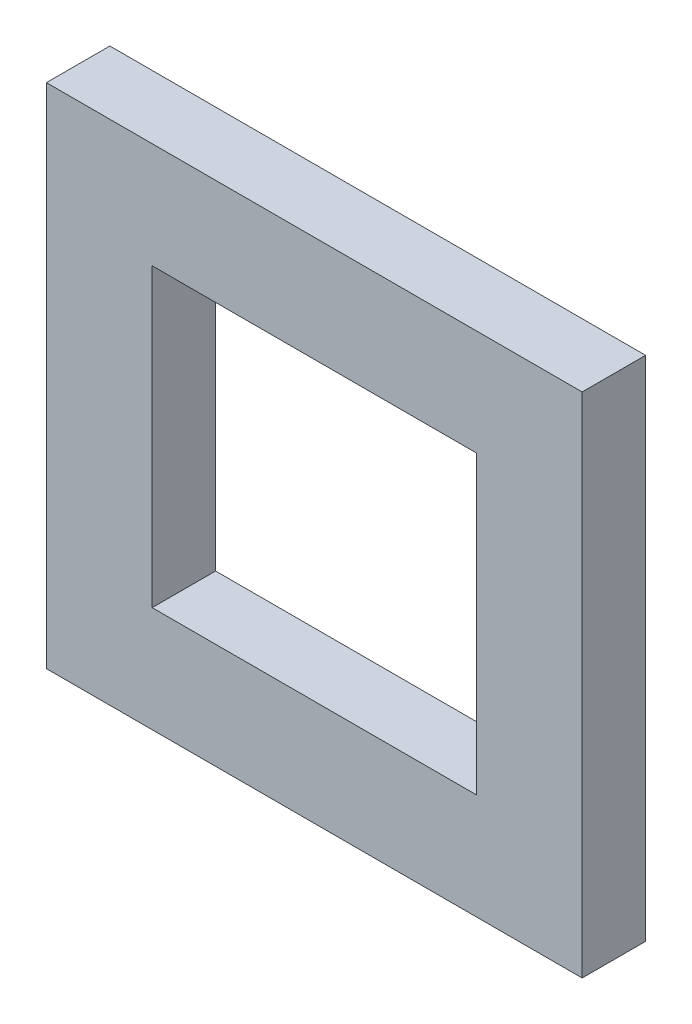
from build123d import *

# Parameters (mm, degrees)
SKETCH1_W           = 241.3
SKETCH1_H           = 228.6
SKETCH1_W_2         = 146.05
SKETCH1_H_2         = 133.35
BOSS_EXTRUDE1_DEPTH = 28.575


with BuildPart() as part:
    # Sketch1 → Boss-Extrude1 (new body)
    with BuildSketch(Plane.XY):
        Rectangle(SKETCH1_W, SKETCH1_H)
        Rectangle(SKETCH1_W_2, SKETCH1_H_2, mode=Mode.SUBTRACT)
    extrude(amount=BOSS_EXTRUDE1_DEPTH)


solid = part.part
